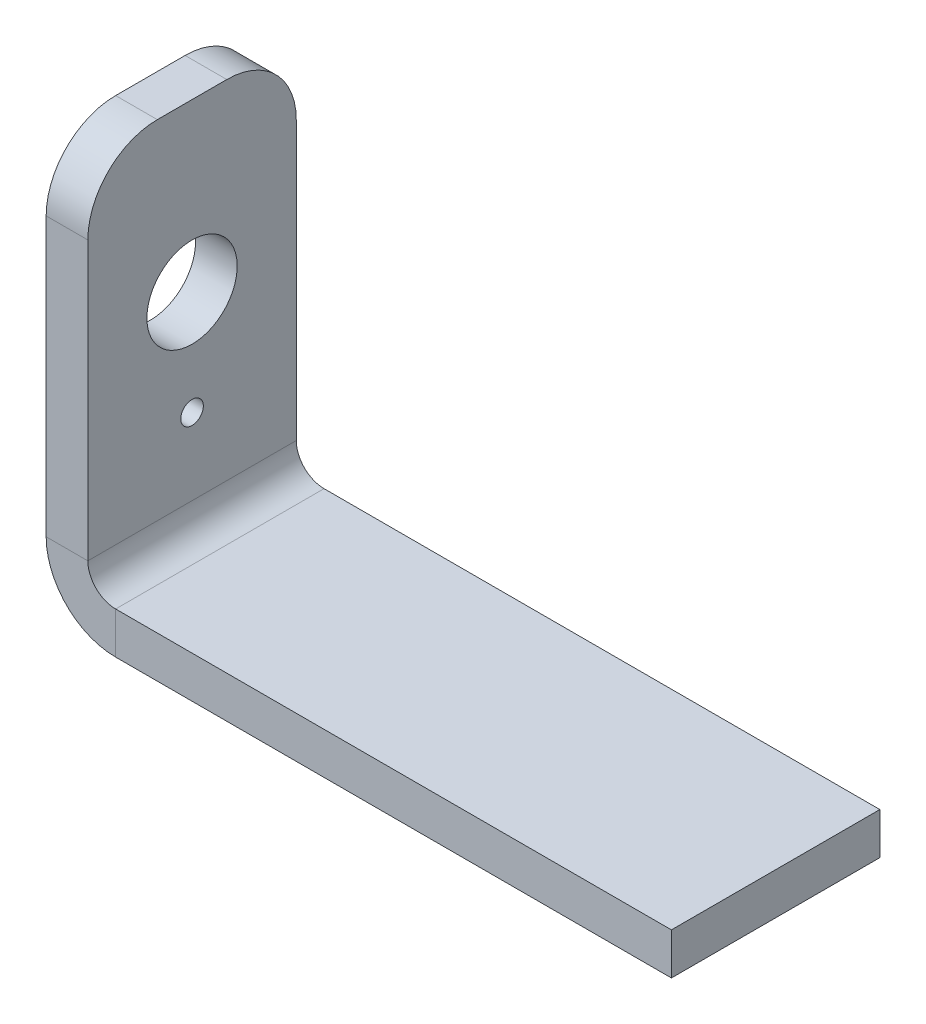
ISO-10303-21;
HEADER;
FILE_DESCRIPTION(('STEP AP214'),'2;1');
FILE_NAME('part.step','',(''),(''),'','','');
FILE_SCHEMA(('AUTOMOTIVE_DESIGN { 1 0 10303 214 1 1 1 1 }'));
ENDSEC;
DATA;
#1=APPLICATION_CONTEXT('core data for automotive mechanical design processes');
#2=APPLICATION_PROTOCOL_DEFINITION('international standard','automotive_design',2000,#1);
#3=PRODUCT_CONTEXT('',#1,'mechanical');
#4=PRODUCT('Part','Part','',(#3));
#5=PRODUCT_RELATED_PRODUCT_CATEGORY('part','',(#4));
#6=PRODUCT_DEFINITION_FORMATION('','',#4);
#7=PRODUCT_DEFINITION_CONTEXT('part definition',#1,'design');
#8=PRODUCT_DEFINITION('design','',#6,#7);
#9=PRODUCT_DEFINITION_SHAPE('','',#8);
#10=(LENGTH_UNIT() NAMED_UNIT(*) SI_UNIT(.MILLI.,.METRE.));
#11=(NAMED_UNIT(*) PLANE_ANGLE_UNIT() SI_UNIT($,.RADIAN.));
#12=(NAMED_UNIT(*) SI_UNIT($,.STERADIAN.) SOLID_ANGLE_UNIT());
#13=UNCERTAINTY_MEASURE_WITH_UNIT(LENGTH_MEASURE(1.E-05),#10,'distance_accuracy_value','');
#14=(GEOMETRIC_REPRESENTATION_CONTEXT(3) GLOBAL_UNCERTAINTY_ASSIGNED_CONTEXT((#13)) GLOBAL_UNIT_ASSIGNED_CONTEXT((#10,
#11,#12)) REPRESENTATION_CONTEXT('',''));
#15=CARTESIAN_POINT('',(0.,0.,0.));
#16=DIRECTION('',(0.,0.,1.));
#17=DIRECTION('',(1.,0.,0.));
#18=AXIS2_PLACEMENT_3D('',#15,#16,#17);
#19=CARTESIAN_POINT('',(20.,-120.,-60.));
#20=DIRECTION('',(0.,0.,-1.));
#21=DIRECTION('',(-1.,0.,0.));
#22=AXIS2_PLACEMENT_3D('',#19,#20,#21);
#23=PLANE('',#22);
#24=DIRECTION('',(0.,1.,0.));
#25=VECTOR('',#24,1.);
#26=CARTESIAN_POINT('',(20.,-120.,-60.));
#27=LINE('',#26,#25);
#28=CARTESIAN_POINT('',(20.,-120.,-60.));
#29=VERTEX_POINT('',#28);
#30=CARTESIAN_POINT('',(20.,-108.,-60.));
#31=VERTEX_POINT('',#30);
#32=EDGE_CURVE('E192',#29,#31,#27,.T.);
#33=ORIENTED_EDGE('',*,*,#32,.F.);
#34=CARTESIAN_POINT('',(20.,-99.9999999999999,-60.));
#35=DIRECTION('',(0.,0.,1.));
#36=DIRECTION('',(-1.,0.,0.));
#37=AXIS2_PLACEMENT_3D('',#34,#35,#36);
#38=CIRCLE('',#37,20.);
#39=CARTESIAN_POINT('',(0.,-99.9999999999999,-60.));
#40=VERTEX_POINT('',#39);
#41=EDGE_CURVE('E122',#40,#29,#38,.T.);
#42=ORIENTED_EDGE('',*,*,#41,.F.);
#43=DIRECTION('',(-1.,0.,0.));
#44=VECTOR('',#43,1.);
#45=CARTESIAN_POINT('',(12.,-99.9999999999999,-60.));
#46=LINE('',#45,#44);
#47=CARTESIAN_POINT('',(12.,-99.9999999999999,-60.));
#48=VERTEX_POINT('',#47);
#49=EDGE_CURVE('E189',#48,#40,#46,.T.);
#50=ORIENTED_EDGE('',*,*,#49,.F.);
#51=CARTESIAN_POINT('',(20.,-99.9999999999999,-60.));
#52=DIRECTION('',(0.,0.,1.));
#53=DIRECTION('',(1.,0.,0.));
#54=AXIS2_PLACEMENT_3D('',#51,#52,#53);
#55=CIRCLE('',#54,8.00000000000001);
#56=EDGE_CURVE('E158',#48,#31,#55,.T.);
#57=ORIENTED_EDGE('',*,*,#56,.T.);
#58=EDGE_LOOP('',(#33,#42,#50,#57));
#59=FACE_BOUND('',#58,.T.);
#60=ADVANCED_FACE('F31',(#59),#23,.T.);
#61=CARTESIAN_POINT('',(12.,-99.9999999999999,-60.));
#62=DIRECTION('',(0.,0.,-1.));
#63=DIRECTION('',(-1.,0.,0.));
#64=AXIS2_PLACEMENT_3D('',#61,#62,#63);
#65=PLANE('',#64);
#66=DIRECTION('',(1.,0.,0.));
#67=VECTOR('',#66,1.);
#68=CARTESIAN_POINT('',(20.,-120.,-60.));
#69=LINE('',#68,#67);
#70=CARTESIAN_POINT('',(180.,-120.,-60.));
#71=VERTEX_POINT('',#70);
#72=EDGE_CURVE('E118',#29,#71,#69,.T.);
#73=ORIENTED_EDGE('',*,*,#72,.F.);
#74=ORIENTED_EDGE('',*,*,#32,.T.);
#75=DIRECTION('',(1.,0.,0.));
#76=VECTOR('',#75,1.);
#77=CARTESIAN_POINT('',(20.,-108.,-60.));
#78=LINE('',#77,#76);
#79=CARTESIAN_POINT('',(180.,-108.,-60.));
#80=VERTEX_POINT('',#79);
#81=EDGE_CURVE('E156',#31,#80,#78,.T.);
#82=ORIENTED_EDGE('',*,*,#81,.T.);
#83=DIRECTION('',(0.,-1.,0.));
#84=VECTOR('',#83,1.);
#85=CARTESIAN_POINT('',(180.,-108.,-60.));
#86=LINE('',#85,#84);
#87=EDGE_CURVE('E154',#80,#71,#86,.T.);
#88=ORIENTED_EDGE('',*,*,#87,.T.);
#89=EDGE_LOOP('',(#73,#74,#82,#88));
#90=FACE_BOUND('',#89,.T.);
#91=ADVANCED_FACE('F232',(#90),#65,.T.);
#92=CARTESIAN_POINT('',(0.,-99.9999999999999,0.));
#93=DIRECTION('',(0.,0.,1.));
#94=DIRECTION('',(1.,0.,0.));
#95=AXIS2_PLACEMENT_3D('',#92,#93,#94);
#96=PLANE('',#95);
#97=DIRECTION('',(1.,0.,0.));
#98=VECTOR('',#97,1.);
#99=CARTESIAN_POINT('',(0.,-99.9999999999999,0.));
#100=LINE('',#99,#98);
#101=CARTESIAN_POINT('',(0.,-99.9999999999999,0.));
#102=VERTEX_POINT('',#101);
#103=CARTESIAN_POINT('',(12.,-99.9999999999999,0.));
#104=VERTEX_POINT('',#103);
#105=EDGE_CURVE('E186',#102,#104,#100,.T.);
#106=ORIENTED_EDGE('',*,*,#105,.F.);
#107=CARTESIAN_POINT('',(20.,-99.9999999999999,0.));
#108=DIRECTION('',(0.,0.,1.));
#109=DIRECTION('',(-1.,0.,0.));
#110=AXIS2_PLACEMENT_3D('',#107,#108,#109);
#111=CIRCLE('',#110,20.);
#112=CARTESIAN_POINT('',(20.,-120.,0.));
#113=VERTEX_POINT('',#112);
#114=EDGE_CURVE('E151',#102,#113,#111,.T.);
#115=ORIENTED_EDGE('',*,*,#114,.T.);
#116=DIRECTION('',(0.,-1.,0.));
#117=VECTOR('',#116,1.);
#118=CARTESIAN_POINT('',(20.,-108.,0.));
#119=LINE('',#118,#117);
#120=CARTESIAN_POINT('',(20.,-108.,0.));
#121=VERTEX_POINT('',#120);
#122=EDGE_CURVE('E134',#121,#113,#119,.T.);
#123=ORIENTED_EDGE('',*,*,#122,.F.);
#124=CARTESIAN_POINT('',(20.,-99.9999999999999,0.));
#125=DIRECTION('',(0.,0.,1.));
#126=DIRECTION('',(1.,0.,0.));
#127=AXIS2_PLACEMENT_3D('',#124,#125,#126);
#128=CIRCLE('',#127,8.00000000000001);
#129=EDGE_CURVE('E144',#104,#121,#128,.T.);
#130=ORIENTED_EDGE('',*,*,#129,.F.);
#131=EDGE_LOOP('',(#106,#115,#123,#130));
#132=FACE_BOUND('',#131,.T.);
#133=ADVANCED_FACE('F225',(#132),#96,.T.);
#134=CARTESIAN_POINT('',(20.,-108.,0.));
#135=DIRECTION('',(0.,0.,1.));
#136=DIRECTION('',(1.,0.,0.));
#137=AXIS2_PLACEMENT_3D('',#134,#135,#136);
#138=PLANE('',#137);
#139=DIRECTION('',(0.,-1.,0.));
#140=VECTOR('',#139,1.);
#141=CARTESIAN_POINT('',(12.,0.,0.));
#142=LINE('',#141,#140);
#143=CARTESIAN_POINT('',(12.,-20.,0.));
#144=VERTEX_POINT('',#143);
#145=EDGE_CURVE('E147',#144,#104,#142,.T.);
#146=ORIENTED_EDGE('',*,*,#145,.F.);
#147=DIRECTION('',(1.,0.,0.));
#148=VECTOR('',#147,1.);
#149=CARTESIAN_POINT('',(0.,-20.,0.));
#150=LINE('',#149,#148);
#151=CARTESIAN_POINT('',(0.,-20.,0.));
#152=VERTEX_POINT('',#151);
#153=EDGE_CURVE('E53',#144,#152,#150,.F.);
#154=ORIENTED_EDGE('',*,*,#153,.T.);
#155=DIRECTION('',(0.,-1.,0.));
#156=VECTOR('',#155,1.);
#157=CARTESIAN_POINT('',(0.,0.,0.));
#158=LINE('',#157,#156);
#159=EDGE_CURVE('E149',#152,#102,#158,.T.);
#160=ORIENTED_EDGE('',*,*,#159,.T.);
#161=ORIENTED_EDGE('',*,*,#105,.T.);
#162=EDGE_LOOP('',(#146,#154,#160,#161));
#163=FACE_BOUND('',#162,.T.);
#164=ADVANCED_FACE('F216',(#163),#138,.T.);
#165=CARTESIAN_POINT('',(20.,-120.,-60.));
#166=DIRECTION('',(0.,-1.,0.));
#167=DIRECTION('',(1.,0.,0.));
#168=AXIS2_PLACEMENT_3D('',#165,#166,#167);
#169=PLANE('',#168);
#170=DIRECTION('',(1.,0.,0.));
#171=VECTOR('',#170,1.);
#172=CARTESIAN_POINT('',(20.,-120.,0.));
#173=LINE('',#172,#171);
#174=CARTESIAN_POINT('',(180.,-120.,0.));
#175=VERTEX_POINT('',#174);
#176=EDGE_CURVE('E115',#113,#175,#173,.T.);
#177=ORIENTED_EDGE('',*,*,#176,.F.);
#178=DIRECTION('',(0.,0.,1.));
#179=VECTOR('',#178,1.);
#180=CARTESIAN_POINT('',(20.,-120.,-60.));
#181=LINE('',#180,#179);
#182=EDGE_CURVE('E167',#29,#113,#181,.T.);
#183=ORIENTED_EDGE('',*,*,#182,.F.);
#184=ORIENTED_EDGE('',*,*,#72,.T.);
#185=DIRECTION('',(0.,0.,1.));
#186=VECTOR('',#185,1.);
#187=CARTESIAN_POINT('',(180.,-120.,-60.));
#188=LINE('',#187,#186);
#189=EDGE_CURVE('E110',#71,#175,#188,.T.);
#190=ORIENTED_EDGE('',*,*,#189,.T.);
#191=EDGE_LOOP('',(#177,#183,#184,#190));
#192=FACE_BOUND('',#191,.T.);
#193=ADVANCED_FACE('F112',(#192),#169,.T.);
#194=CARTESIAN_POINT('',(20.,-99.9999999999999,-60.));
#195=DIRECTION('',(0.,0.,1.));
#196=DIRECTION('',(1.,0.,0.));
#197=AXIS2_PLACEMENT_3D('',#194,#195,#196);
#198=CYLINDRICAL_SURFACE('',#197,20.);
#199=ORIENTED_EDGE('',*,*,#114,.F.);
#200=DIRECTION('',(0.,0.,1.));
#201=VECTOR('',#200,1.);
#202=CARTESIAN_POINT('',(0.,-99.9999999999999,-60.));
#203=LINE('',#202,#201);
#204=EDGE_CURVE('E169',#40,#102,#203,.T.);
#205=ORIENTED_EDGE('',*,*,#204,.F.);
#206=ORIENTED_EDGE('',*,*,#41,.T.);
#207=ORIENTED_EDGE('',*,*,#182,.T.);
#208=EDGE_LOOP('',(#199,#205,#206,#207));
#209=FACE_BOUND('',#208,.T.);
#210=ADVANCED_FACE('F229',(#209),#198,.T.);
#211=CARTESIAN_POINT('',(0.,0.,-60.));
#212=DIRECTION('',(-1.,0.,0.));
#213=DIRECTION('',(0.,-1.,0.));
#214=AXIS2_PLACEMENT_3D('',#211,#212,#213);
#215=PLANE('',#214);
#216=CARTESIAN_POINT('',(0.,-78.,-30.));
#217=DIRECTION('',(-1.,0.,0.));
#218=DIRECTION('',(0.,-1.,0.));
#219=AXIS2_PLACEMENT_3D('',#216,#217,#218);
#220=CIRCLE('',#219,3.25);
#221=CARTESIAN_POINT('',(0.,-81.25,-30.));
#222=VERTEX_POINT('',#221);
#223=EDGE_CURVE('E294',#222,#222,#220,.T.);
#224=ORIENTED_EDGE('',*,*,#223,.F.);
#225=EDGE_LOOP('',(#224));
#226=FACE_BOUND('',#225,.T.);
#227=CARTESIAN_POINT('',(0.,-48.,-30.));
#228=DIRECTION('',(-1.,0.,0.));
#229=DIRECTION('',(0.,-1.,0.));
#230=AXIS2_PLACEMENT_3D('',#227,#228,#229);
#231=CIRCLE('',#230,13.);
#232=CARTESIAN_POINT('',(0.,-61.,-30.));
#233=VERTEX_POINT('',#232);
#234=EDGE_CURVE('E139',#233,#233,#231,.T.);
#235=ORIENTED_EDGE('',*,*,#234,.F.);
#236=EDGE_LOOP('',(#235));
#237=FACE_BOUND('',#236,.T.);
#238=ORIENTED_EDGE('',*,*,#159,.F.);
#239=CARTESIAN_POINT('',(0.,-20.,-20.));
#240=DIRECTION('',(-1.,0.,0.));
#241=DIRECTION('',(0.,-1.,0.));
#242=AXIS2_PLACEMENT_3D('',#239,#240,#241);
#243=CIRCLE('',#242,20.);
#244=CARTESIAN_POINT('',(0.,0.,-20.));
#245=VERTEX_POINT('',#244);
#246=EDGE_CURVE('E38',#152,#245,#243,.T.);
#247=ORIENTED_EDGE('',*,*,#246,.T.);
#248=DIRECTION('',(0.,0.,1.));
#249=VECTOR('',#248,1.);
#250=CARTESIAN_POINT('',(0.,0.,-60.));
#251=LINE('',#250,#249);
#252=CARTESIAN_POINT('',(0.,0.,-40.));
#253=VERTEX_POINT('',#252);
#254=EDGE_CURVE('E172',#253,#245,#251,.T.);
#255=ORIENTED_EDGE('',*,*,#254,.F.);
#256=CARTESIAN_POINT('',(0.,-20.,-40.));
#257=DIRECTION('',(-1.,0.,0.));
#258=DIRECTION('',(0.,-1.,0.));
#259=AXIS2_PLACEMENT_3D('',#256,#257,#258);
#260=CIRCLE('',#259,20.);
#261=CARTESIAN_POINT('',(0.,-20.,-60.));
#262=VERTEX_POINT('',#261);
#263=EDGE_CURVE('E45',#253,#262,#260,.T.);
#264=ORIENTED_EDGE('',*,*,#263,.T.);
#265=DIRECTION('',(0.,-1.,0.));
#266=VECTOR('',#265,1.);
#267=CARTESIAN_POINT('',(0.,0.,-60.));
#268=LINE('',#267,#266);
#269=EDGE_CURVE('E163',#262,#40,#268,.T.);
#270=ORIENTED_EDGE('',*,*,#269,.T.);
#271=ORIENTED_EDGE('',*,*,#204,.T.);
#272=EDGE_LOOP('',(#238,#247,#255,#264,#270,#271));
#273=FACE_BOUND('',#272,.T.);
#274=ADVANCED_FACE('F205',(#226,#237,#273),#215,.T.);
#275=CARTESIAN_POINT('',(0.,0.,-60.));
#276=DIRECTION('',(0.,-1.,0.));
#277=DIRECTION('',(1.,0.,0.));
#278=AXIS2_PLACEMENT_3D('',#275,#276,#277);
#279=PLANE('',#278);
#280=ORIENTED_EDGE('',*,*,#254,.T.);
#281=DIRECTION('',(1.,0.,0.));
#282=VECTOR('',#281,1.);
#283=CARTESIAN_POINT('',(12.,0.,-20.));
#284=LINE('',#283,#282);
#285=CARTESIAN_POINT('',(12.,0.,-20.));
#286=VERTEX_POINT('',#285);
#287=EDGE_CURVE('E196',#245,#286,#284,.T.);
#288=ORIENTED_EDGE('',*,*,#287,.T.);
#289=DIRECTION('',(0.,0.,1.));
#290=VECTOR('',#289,1.);
#291=CARTESIAN_POINT('',(12.,0.,-60.));
#292=LINE('',#291,#290);
#293=CARTESIAN_POINT('',(12.,0.,-40.));
#294=VERTEX_POINT('',#293);
#295=EDGE_CURVE('E175',#294,#286,#292,.T.);
#296=ORIENTED_EDGE('',*,*,#295,.F.);
#297=DIRECTION('',(1.,0.,0.));
#298=VECTOR('',#297,1.);
#299=CARTESIAN_POINT('',(0.,0.,-40.));
#300=LINE('',#299,#298);
#301=EDGE_CURVE('E194',#294,#253,#300,.F.);
#302=ORIENTED_EDGE('',*,*,#301,.T.);
#303=EDGE_LOOP('',(#280,#288,#296,#302));
#304=FACE_BOUND('',#303,.T.);
#305=ADVANCED_FACE('F209',(#304),#279,.F.);
#306=CARTESIAN_POINT('',(12.,0.,-60.));
#307=DIRECTION('',(-1.,0.,0.));
#308=DIRECTION('',(0.,-1.,0.));
#309=AXIS2_PLACEMENT_3D('',#306,#307,#308);
#310=PLANE('',#309);
#311=CARTESIAN_POINT('',(12.,-78.,-30.));
#312=DIRECTION('',(-1.,0.,0.));
#313=DIRECTION('',(0.,-1.,0.));
#314=AXIS2_PLACEMENT_3D('',#311,#312,#313);
#315=CIRCLE('',#314,3.25);
#316=CARTESIAN_POINT('',(12.,-81.25,-30.));
#317=VERTEX_POINT('',#316);
#318=EDGE_CURVE('E288',#317,#317,#315,.T.);
#319=ORIENTED_EDGE('',*,*,#318,.T.);
#320=EDGE_LOOP('',(#319));
#321=FACE_BOUND('',#320,.T.);
#322=CARTESIAN_POINT('',(12.,-48.,-30.));
#323=DIRECTION('',(-1.,0.,0.));
#324=DIRECTION('',(0.,-1.,0.));
#325=AXIS2_PLACEMENT_3D('',#322,#323,#324);
#326=CIRCLE('',#325,13.);
#327=CARTESIAN_POINT('',(12.,-61.,-30.));
#328=VERTEX_POINT('',#327);
#329=EDGE_CURVE('E136',#328,#328,#326,.T.);
#330=ORIENTED_EDGE('',*,*,#329,.T.);
#331=EDGE_LOOP('',(#330));
#332=FACE_BOUND('',#331,.T.);
#333=ORIENTED_EDGE('',*,*,#295,.T.);
#334=CARTESIAN_POINT('',(12.,-20.,-20.));
#335=DIRECTION('',(-1.,0.,0.));
#336=DIRECTION('',(0.,-1.,0.));
#337=AXIS2_PLACEMENT_3D('',#334,#335,#336);
#338=CIRCLE('',#337,20.);
#339=EDGE_CURVE('E201',#286,#144,#338,.F.);
#340=ORIENTED_EDGE('',*,*,#339,.T.);
#341=ORIENTED_EDGE('',*,*,#145,.T.);
#342=DIRECTION('',(0.,0.,1.));
#343=VECTOR('',#342,1.);
#344=CARTESIAN_POINT('',(12.,-99.9999999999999,-60.));
#345=LINE('',#344,#343);
#346=EDGE_CURVE('E178',#48,#104,#345,.T.);
#347=ORIENTED_EDGE('',*,*,#346,.F.);
#348=DIRECTION('',(0.,-1.,0.));
#349=VECTOR('',#348,1.);
#350=CARTESIAN_POINT('',(12.,0.,-60.));
#351=LINE('',#350,#349);
#352=CARTESIAN_POINT('',(12.,-20.,-60.));
#353=VERTEX_POINT('',#352);
#354=EDGE_CURVE('E161',#353,#48,#351,.T.);
#355=ORIENTED_EDGE('',*,*,#354,.F.);
#356=CARTESIAN_POINT('',(12.,-20.,-40.));
#357=DIRECTION('',(-1.,0.,0.));
#358=DIRECTION('',(0.,-1.,0.));
#359=AXIS2_PLACEMENT_3D('',#356,#357,#358);
#360=CIRCLE('',#359,20.);
#361=EDGE_CURVE('E199',#353,#294,#360,.F.);
#362=ORIENTED_EDGE('',*,*,#361,.T.);
#363=EDGE_LOOP('',(#333,#340,#341,#347,#355,#362));
#364=FACE_BOUND('',#363,.T.);
#365=ADVANCED_FACE('F214',(#321,#332,#364),#310,.F.);
#366=CARTESIAN_POINT('',(20.,-99.9999999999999,-60.));
#367=DIRECTION('',(0.,0.,1.));
#368=DIRECTION('',(1.,0.,0.));
#369=AXIS2_PLACEMENT_3D('',#366,#367,#368);
#370=CYLINDRICAL_SURFACE('',#369,8.00000000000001);
#371=ORIENTED_EDGE('',*,*,#129,.T.);
#372=DIRECTION('',(0.,0.,1.));
#373=VECTOR('',#372,1.);
#374=CARTESIAN_POINT('',(20.,-108.,-60.));
#375=LINE('',#374,#373);
#376=EDGE_CURVE('E181',#31,#121,#375,.T.);
#377=ORIENTED_EDGE('',*,*,#376,.F.);
#378=ORIENTED_EDGE('',*,*,#56,.F.);
#379=ORIENTED_EDGE('',*,*,#346,.T.);
#380=EDGE_LOOP('',(#371,#377,#378,#379));
#381=FACE_BOUND('',#380,.T.);
#382=ADVANCED_FACE('F222',(#381),#370,.F.);
#383=CARTESIAN_POINT('',(20.,-108.,-60.));
#384=DIRECTION('',(0.,-1.,0.));
#385=DIRECTION('',(1.,0.,0.));
#386=AXIS2_PLACEMENT_3D('',#383,#384,#385);
#387=PLANE('',#386);
#388=DIRECTION('',(1.,0.,0.));
#389=VECTOR('',#388,1.);
#390=CARTESIAN_POINT('',(20.,-108.,0.));
#391=LINE('',#390,#389);
#392=CARTESIAN_POINT('',(180.,-108.,0.));
#393=VERTEX_POINT('',#392);
#394=EDGE_CURVE('E131',#121,#393,#391,.T.);
#395=ORIENTED_EDGE('',*,*,#394,.T.);
#396=DIRECTION('',(0.,0.,1.));
#397=VECTOR('',#396,1.);
#398=CARTESIAN_POINT('',(180.,-108.,-60.));
#399=LINE('',#398,#397);
#400=EDGE_CURVE('E121',#80,#393,#399,.T.);
#401=ORIENTED_EDGE('',*,*,#400,.F.);
#402=ORIENTED_EDGE('',*,*,#81,.F.);
#403=ORIENTED_EDGE('',*,*,#376,.T.);
#404=EDGE_LOOP('',(#395,#401,#402,#403));
#405=FACE_BOUND('',#404,.T.);
#406=ADVANCED_FACE('F235',(#405),#387,.F.);
#407=CARTESIAN_POINT('',(180.,-108.,-60.));
#408=DIRECTION('',(-1.,0.,0.));
#409=DIRECTION('',(0.,0.,1.));
#410=AXIS2_PLACEMENT_3D('',#407,#408,#409);
#411=PLANE('',#410);
#412=DIRECTION('',(0.,-1.,0.));
#413=VECTOR('',#412,1.);
#414=CARTESIAN_POINT('',(180.,-108.,0.));
#415=LINE('',#414,#413);
#416=EDGE_CURVE('E126',#393,#175,#415,.T.);
#417=ORIENTED_EDGE('',*,*,#416,.T.);
#418=ORIENTED_EDGE('',*,*,#189,.F.);
#419=ORIENTED_EDGE('',*,*,#87,.F.);
#420=ORIENTED_EDGE('',*,*,#400,.T.);
#421=EDGE_LOOP('',(#417,#418,#419,#420));
#422=FACE_BOUND('',#421,.T.);
#423=ADVANCED_FACE('F127',(#422),#411,.F.);
#424=CARTESIAN_POINT('',(20.,-99.9999999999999,-60.));
#425=DIRECTION('',(0.,0.,1.));
#426=DIRECTION('',(1.,0.,0.));
#427=AXIS2_PLACEMENT_3D('',#424,#425,#426);
#428=PLANE('',#427);
#429=ORIENTED_EDGE('',*,*,#269,.F.);
#430=DIRECTION('',(1.,0.,0.));
#431=VECTOR('',#430,1.);
#432=CARTESIAN_POINT('',(20.,-20.,-60.));
#433=LINE('',#432,#431);
#434=EDGE_CURVE('E11',#262,#353,#433,.T.);
#435=ORIENTED_EDGE('',*,*,#434,.T.);
#436=ORIENTED_EDGE('',*,*,#354,.T.);
#437=ORIENTED_EDGE('',*,*,#49,.T.);
#438=EDGE_LOOP('',(#429,#435,#436,#437));
#439=FACE_BOUND('',#438,.T.);
#440=ADVANCED_FACE('F242',(#439),#428,.F.);
#441=CARTESIAN_POINT('',(20.,-99.9999999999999,0.));
#442=DIRECTION('',(0.,0.,1.));
#443=DIRECTION('',(1.,0.,0.));
#444=AXIS2_PLACEMENT_3D('',#441,#442,#443);
#445=PLANE('',#444);
#446=ORIENTED_EDGE('',*,*,#176,.T.);
#447=ORIENTED_EDGE('',*,*,#416,.F.);
#448=ORIENTED_EDGE('',*,*,#394,.F.);
#449=ORIENTED_EDGE('',*,*,#122,.T.);
#450=EDGE_LOOP('',(#446,#447,#448,#449));
#451=FACE_BOUND('',#450,.T.);
#452=ADVANCED_FACE('F133',(#451),#445,.T.);
#453=CARTESIAN_POINT('',(12.,-48.,-30.));
#454=DIRECTION('',(-1.,0.,0.));
#455=DIRECTION('',(0.,-1.,0.));
#456=AXIS2_PLACEMENT_3D('',#453,#454,#455);
#457=CYLINDRICAL_SURFACE('',#456,13.);
#458=ORIENTED_EDGE('',*,*,#329,.F.);
#459=EDGE_LOOP('',(#458));
#460=FACE_BOUND('',#459,.T.);
#461=ORIENTED_EDGE('',*,*,#234,.T.);
#462=EDGE_LOOP('',(#461));
#463=FACE_BOUND('',#462,.T.);
#464=ADVANCED_FACE('F265',(#460,#463),#457,.F.);
#465=CARTESIAN_POINT('',(12.,-78.,-30.));
#466=DIRECTION('',(-1.,0.,0.));
#467=DIRECTION('',(0.,-1.,0.));
#468=AXIS2_PLACEMENT_3D('',#465,#466,#467);
#469=CYLINDRICAL_SURFACE('',#468,3.25);
#470=ORIENTED_EDGE('',*,*,#318,.F.);
#471=EDGE_LOOP('',(#470));
#472=FACE_BOUND('',#471,.T.);
#473=ORIENTED_EDGE('',*,*,#223,.T.);
#474=EDGE_LOOP('',(#473));
#475=FACE_BOUND('',#474,.T.);
#476=ADVANCED_FACE('F260',(#472,#475),#469,.F.);
#477=CARTESIAN_POINT('',(0.,-20.,-20.));
#478=DIRECTION('',(-1.,0.,0.));
#479=DIRECTION('',(0.,-1.,0.));
#480=AXIS2_PLACEMENT_3D('',#477,#478,#479);
#481=CYLINDRICAL_SURFACE('',#480,20.);
#482=ORIENTED_EDGE('',*,*,#246,.F.);
#483=ORIENTED_EDGE('',*,*,#153,.F.);
#484=ORIENTED_EDGE('',*,*,#339,.F.);
#485=ORIENTED_EDGE('',*,*,#287,.F.);
#486=EDGE_LOOP('',(#482,#483,#484,#485));
#487=FACE_BOUND('',#486,.T.);
#488=ADVANCED_FACE('F212',(#487),#481,.T.);
#489=CARTESIAN_POINT('',(20.,-20.,-40.));
#490=DIRECTION('',(1.,0.,0.));
#491=DIRECTION('',(0.,1.,0.));
#492=AXIS2_PLACEMENT_3D('',#489,#490,#491);
#493=CYLINDRICAL_SURFACE('',#492,20.);
#494=ORIENTED_EDGE('',*,*,#263,.F.);
#495=ORIENTED_EDGE('',*,*,#301,.F.);
#496=ORIENTED_EDGE('',*,*,#361,.F.);
#497=ORIENTED_EDGE('',*,*,#434,.F.);
#498=EDGE_LOOP('',(#494,#495,#496,#497));
#499=FACE_BOUND('',#498,.T.);
#500=ADVANCED_FACE('F254',(#499),#493,.T.);
#501=CLOSED_SHELL('',(#60,#91,#133,#164,#193,#210,#274,#305,#365,#382,#406,#423,#440,#452,#464,
#476,#488,#500));
#502=MANIFOLD_SOLID_BREP('B2',#501);
#503=ADVANCED_BREP_SHAPE_REPRESENTATION('',(#18,#502),#14);
#504=SHAPE_DEFINITION_REPRESENTATION(#9,#503);
ENDSEC;
END-ISO-10303-21;
